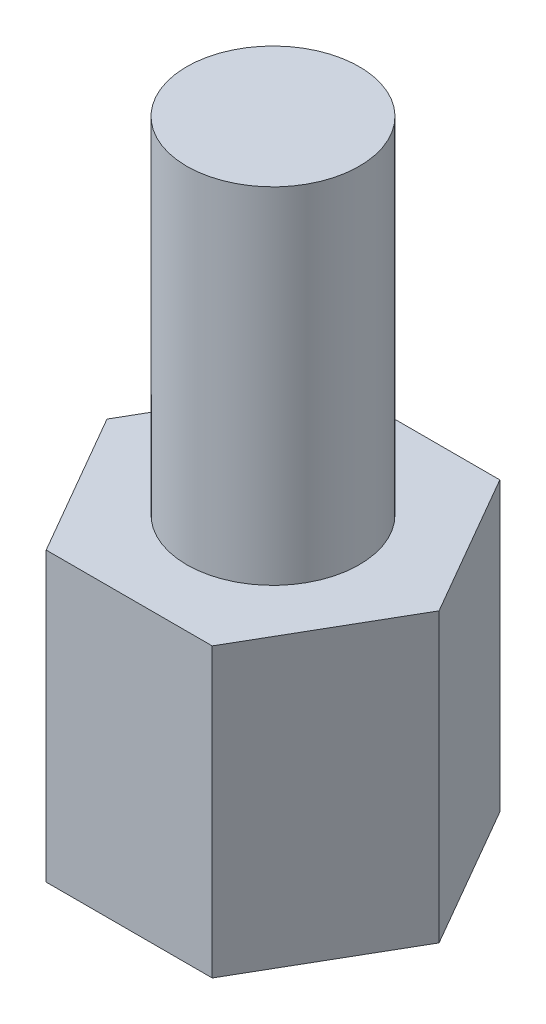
from build123d import *

# Parameters (mm, degrees)
SKETCH_1_R      = 1.5
EXTRUDE_1_DEPTH = 5
SKETCH_2_R      = 1.5
EXTRUDE_2_DEPTH = 6


with BuildPart() as part:
    # Sketch 1 → Extrude 1 (new body)
    with BuildSketch(Plane(origin=(0, 0, 0), x_dir=(1, 0, 0), z_dir=(0, 1, 0))):
        Polygon((2.886751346, 0), (1.443375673, 2.5), (-1.443375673, 2.5), (-2.886751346, 0), (-1.443375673, -2.5), (1.443375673, -2.5), align=None)
        with Locations(Location((0, 0, 0), (0, 0, 270))):
            Circle(SKETCH_1_R, mode=Mode.SUBTRACT)
    extrude(amount=EXTRUDE_1_DEPTH)


with BuildPart() as body_2:
    # Sketch 2 → Extrude 2 (new body)
    with BuildSketch(Plane(origin=(0, 5, 0), x_dir=(1, 0, 0), z_dir=(0, 1, 0))):
        with Locations(Location((0, 0, 0), (0, 0, 270))):
            Circle(SKETCH_2_R)
    extrude(amount=EXTRUDE_2_DEPTH)


solid = Compound([part.part, body_2.part])
